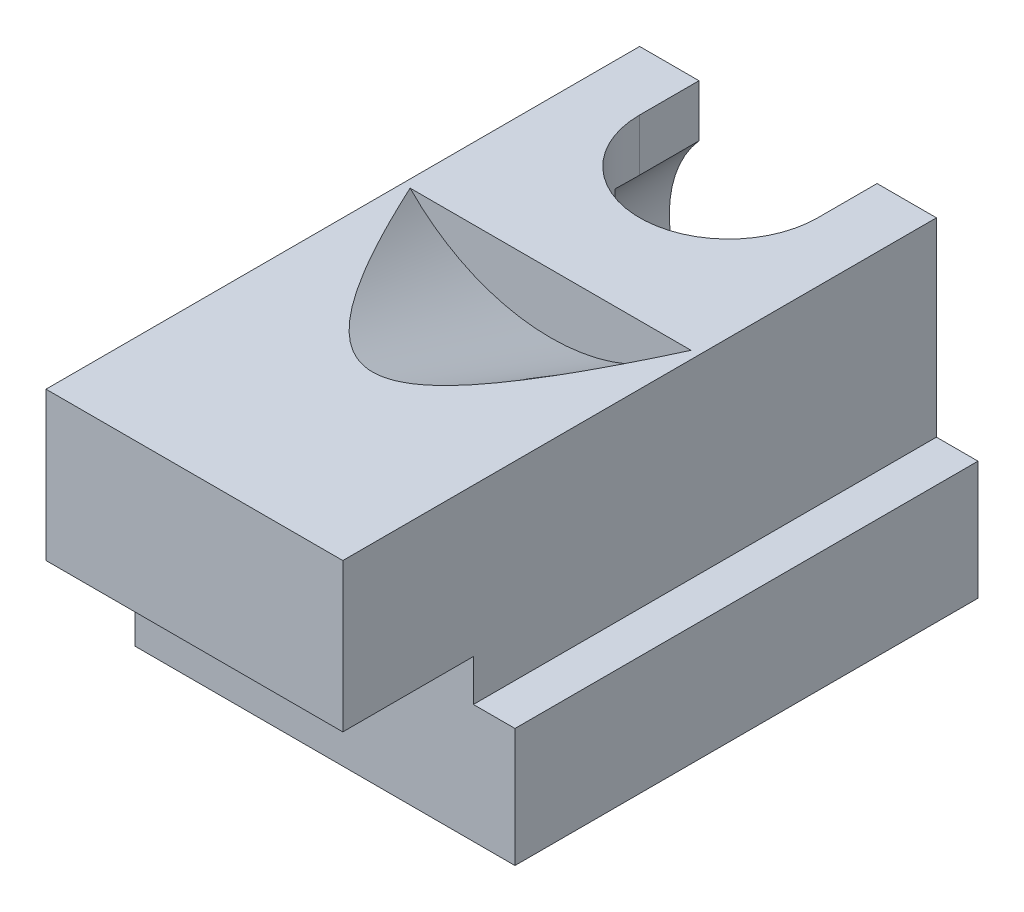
ISO-10303-21;
HEADER;
FILE_DESCRIPTION(('STEP AP214'),'2;1');
FILE_NAME('part.step','',(''),(''),'','','');
FILE_SCHEMA(('AUTOMOTIVE_DESIGN { 1 0 10303 214 1 1 1 1 }'));
ENDSEC;
DATA;
#1=APPLICATION_CONTEXT('core data for automotive mechanical design processes');
#2=APPLICATION_PROTOCOL_DEFINITION('international standard','automotive_design',2000,#1);
#3=PRODUCT_CONTEXT('',#1,'mechanical');
#4=PRODUCT('Part','Part','',(#3));
#5=PRODUCT_RELATED_PRODUCT_CATEGORY('part','',(#4));
#6=PRODUCT_DEFINITION_FORMATION('','',#4);
#7=PRODUCT_DEFINITION_CONTEXT('part definition',#1,'design');
#8=PRODUCT_DEFINITION('design','',#6,#7);
#9=PRODUCT_DEFINITION_SHAPE('','',#8);
#10=(LENGTH_UNIT() NAMED_UNIT(*) SI_UNIT(.MILLI.,.METRE.));
#11=(NAMED_UNIT(*) PLANE_ANGLE_UNIT() SI_UNIT($,.RADIAN.));
#12=(NAMED_UNIT(*) SI_UNIT($,.STERADIAN.) SOLID_ANGLE_UNIT());
#13=UNCERTAINTY_MEASURE_WITH_UNIT(LENGTH_MEASURE(1.E-05),#10,'distance_accuracy_value','');
#14=(GEOMETRIC_REPRESENTATION_CONTEXT(3) GLOBAL_UNCERTAINTY_ASSIGNED_CONTEXT((#13)) GLOBAL_UNIT_ASSIGNED_CONTEXT((#10,
#11,#12)) REPRESENTATION_CONTEXT('',''));
#15=CARTESIAN_POINT('',(0.,0.,0.));
#16=DIRECTION('',(0.,0.,1.));
#17=DIRECTION('',(1.,0.,0.));
#18=AXIS2_PLACEMENT_3D('',#15,#16,#17);
#19=CARTESIAN_POINT('',(-3.2,0.,10.));
#20=DIRECTION('',(1.,0.,0.));
#21=DIRECTION('',(0.,1.,0.));
#22=AXIS2_PLACEMENT_3D('',#19,#20,#21);
#23=PLANE('',#22);
#24=DIRECTION('',(0.,0.,-1.));
#25=VECTOR('',#24,1.);
#26=CARTESIAN_POINT('',(-3.2,0.,10.));
#27=LINE('',#26,#25);
#28=CARTESIAN_POINT('',(-3.2,0.,7.8));
#29=VERTEX_POINT('',#28);
#30=CARTESIAN_POINT('',(-3.2,0.,0.));
#31=VERTEX_POINT('',#30);
#32=EDGE_CURVE('E296',#29,#31,#27,.T.);
#33=ORIENTED_EDGE('',*,*,#32,.F.);
#34=DIRECTION('',(0.,1.,0.));
#35=VECTOR('',#34,1.);
#36=CARTESIAN_POINT('',(-3.2,0.,7.8));
#37=LINE('',#36,#35);
#38=CARTESIAN_POINT('',(-3.2,2.,7.8));
#39=VERTEX_POINT('',#38);
#40=EDGE_CURVE('E530',#29,#39,#37,.T.);
#41=ORIENTED_EDGE('',*,*,#40,.T.);
#42=DIRECTION('',(0.,0.,-1.));
#43=VECTOR('',#42,1.);
#44=CARTESIAN_POINT('',(-3.2,2.,10.));
#45=LINE('',#44,#43);
#46=CARTESIAN_POINT('',(-3.2,2.,0.));
#47=VERTEX_POINT('',#46);
#48=EDGE_CURVE('E309',#39,#47,#45,.T.);
#49=ORIENTED_EDGE('',*,*,#48,.T.);
#50=DIRECTION('',(0.,-1.,0.));
#51=VECTOR('',#50,1.);
#52=CARTESIAN_POINT('',(-3.2,0.,0.));
#53=LINE('',#52,#51);
#54=EDGE_CURVE('E317',#47,#31,#53,.T.);
#55=ORIENTED_EDGE('',*,*,#54,.T.);
#56=EDGE_LOOP('',(#33,#41,#49,#55));
#57=FACE_BOUND('',#56,.T.);
#58=ADVANCED_FACE('F32',(#57),#23,.F.);
#59=CARTESIAN_POINT('',(3.20000000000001,0.,10.));
#60=DIRECTION('',(0.,1.,0.));
#61=DIRECTION('',(-1.,0.,0.));
#62=AXIS2_PLACEMENT_3D('',#59,#60,#61);
#63=PLANE('',#62);
#64=DIRECTION('',(0.,0.,-1.));
#65=VECTOR('',#64,1.);
#66=CARTESIAN_POINT('',(3.20000000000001,0.,10.));
#67=LINE('',#66,#65);
#68=CARTESIAN_POINT('',(3.20000000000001,0.,7.8));
#69=VERTEX_POINT('',#68);
#70=CARTESIAN_POINT('',(3.20000000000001,0.,0.));
#71=VERTEX_POINT('',#70);
#72=EDGE_CURVE('E351',#69,#71,#67,.T.);
#73=ORIENTED_EDGE('',*,*,#72,.F.);
#74=DIRECTION('',(1.,0.,0.));
#75=VECTOR('',#74,1.);
#76=CARTESIAN_POINT('',(-3.2,0.,7.8));
#77=LINE('',#76,#75);
#78=EDGE_CURVE('E535',#29,#69,#77,.T.);
#79=ORIENTED_EDGE('',*,*,#78,.F.);
#80=ORIENTED_EDGE('',*,*,#32,.T.);
#81=DIRECTION('',(1.,0.,0.));
#82=VECTOR('',#81,1.);
#83=CARTESIAN_POINT('',(3.20000000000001,0.,0.));
#84=LINE('',#83,#82);
#85=EDGE_CURVE('E320',#31,#71,#84,.T.);
#86=ORIENTED_EDGE('',*,*,#85,.T.);
#87=EDGE_LOOP('',(#73,#79,#80,#86));
#88=FACE_BOUND('',#87,.T.);
#89=ADVANCED_FACE('F242',(#88),#63,.F.);
#90=CARTESIAN_POINT('',(3.20000000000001,0.,10.));
#91=DIRECTION('',(-1.,0.,0.));
#92=DIRECTION('',(0.,-1.,0.));
#93=AXIS2_PLACEMENT_3D('',#90,#91,#92);
#94=PLANE('',#93);
#95=DIRECTION('',(0.,0.,-1.));
#96=VECTOR('',#95,1.);
#97=CARTESIAN_POINT('',(3.2,2.,10.));
#98=LINE('',#97,#96);
#99=CARTESIAN_POINT('',(3.2,2.,7.8));
#100=VERTEX_POINT('',#99);
#101=CARTESIAN_POINT('',(3.2,2.,0.));
#102=VERTEX_POINT('',#101);
#103=EDGE_CURVE('E349',#100,#102,#98,.T.);
#104=ORIENTED_EDGE('',*,*,#103,.F.);
#105=DIRECTION('',(0.,1.,0.));
#106=VECTOR('',#105,1.);
#107=CARTESIAN_POINT('',(3.20000000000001,0.,7.8));
#108=LINE('',#107,#106);
#109=EDGE_CURVE('E528',#69,#100,#108,.T.);
#110=ORIENTED_EDGE('',*,*,#109,.F.);
#111=ORIENTED_EDGE('',*,*,#72,.T.);
#112=DIRECTION('',(0.,1.,0.));
#113=VECTOR('',#112,1.);
#114=CARTESIAN_POINT('',(3.20000000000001,0.,0.));
#115=LINE('',#114,#113);
#116=EDGE_CURVE('E324',#71,#102,#115,.T.);
#117=ORIENTED_EDGE('',*,*,#116,.T.);
#118=EDGE_LOOP('',(#104,#110,#111,#117));
#119=FACE_BOUND('',#118,.T.);
#120=ADVANCED_FACE('F247',(#119),#94,.F.);
#121=CARTESIAN_POINT('',(3.2,2.,10.));
#122=DIRECTION('',(0.,-1.,0.));
#123=DIRECTION('',(0.,0.,-1.));
#124=AXIS2_PLACEMENT_3D('',#121,#122,#123);
#125=PLANE('',#124);
#126=DIRECTION('',(0.,0.,-1.));
#127=VECTOR('',#126,1.);
#128=CARTESIAN_POINT('',(2.5,2.,10.));
#129=LINE('',#128,#127);
#130=CARTESIAN_POINT('',(2.5,2.,7.8));
#131=VERTEX_POINT('',#130);
#132=CARTESIAN_POINT('',(2.5,2.,0.));
#133=VERTEX_POINT('',#132);
#134=EDGE_CURVE('E347',#131,#133,#129,.T.);
#135=ORIENTED_EDGE('',*,*,#134,.F.);
#136=DIRECTION('',(1.,0.,0.));
#137=VECTOR('',#136,1.);
#138=CARTESIAN_POINT('',(3.2,2.,7.8));
#139=LINE('',#138,#137);
#140=EDGE_CURVE('E321',#131,#100,#139,.T.);
#141=ORIENTED_EDGE('',*,*,#140,.T.);
#142=ORIENTED_EDGE('',*,*,#103,.T.);
#143=DIRECTION('',(-1.,0.,0.));
#144=VECTOR('',#143,1.);
#145=CARTESIAN_POINT('',(3.2,2.,0.));
#146=LINE('',#145,#144);
#147=EDGE_CURVE('E327',#102,#133,#146,.T.);
#148=ORIENTED_EDGE('',*,*,#147,.T.);
#149=EDGE_LOOP('',(#135,#141,#142,#148));
#150=FACE_BOUND('',#149,.T.);
#151=ADVANCED_FACE('F254',(#150),#125,.F.);
#152=CARTESIAN_POINT('',(2.5,2.,10.));
#153=DIRECTION('',(-1.,0.,0.));
#154=DIRECTION('',(0.,-1.,0.));
#155=AXIS2_PLACEMENT_3D('',#152,#153,#154);
#156=PLANE('',#155);
#157=DIRECTION('',(0.,1.,0.));
#158=VECTOR('',#157,1.);
#159=CARTESIAN_POINT('',(2.5,2.,10.));
#160=LINE('',#159,#158);
#161=CARTESIAN_POINT('',(2.5,2.69999999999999,10.));
#162=VERTEX_POINT('',#161);
#163=CARTESIAN_POINT('',(2.5,5.2,10.));
#164=VERTEX_POINT('',#163);
#165=EDGE_CURVE('E313',#162,#164,#160,.T.);
#166=ORIENTED_EDGE('',*,*,#165,.F.);
#167=DIRECTION('',(0.,0.,-1.));
#168=VECTOR('',#167,1.);
#169=CARTESIAN_POINT('',(2.5,2.7,10.));
#170=LINE('',#169,#168);
#171=CARTESIAN_POINT('',(2.5,2.7,7.8));
#172=VERTEX_POINT('',#171);
#173=EDGE_CURVE('E292',#162,#172,#170,.T.);
#174=ORIENTED_EDGE('',*,*,#173,.T.);
#175=DIRECTION('',(0.,-1.,0.));
#176=VECTOR('',#175,1.);
#177=CARTESIAN_POINT('',(2.5,2.,7.8));
#178=LINE('',#177,#176);
#179=EDGE_CURVE('E541',#172,#131,#178,.T.);
#180=ORIENTED_EDGE('',*,*,#179,.T.);
#181=ORIENTED_EDGE('',*,*,#134,.T.);
#182=DIRECTION('',(0.,1.,0.));
#183=VECTOR('',#182,1.);
#184=CARTESIAN_POINT('',(2.5,2.,0.));
#185=LINE('',#184,#183);
#186=CARTESIAN_POINT('',(2.5,5.2,0.));
#187=VERTEX_POINT('',#186);
#188=EDGE_CURVE('E330',#133,#187,#185,.T.);
#189=ORIENTED_EDGE('',*,*,#188,.T.);
#190=DIRECTION('',(0.,0.,-1.));
#191=VECTOR('',#190,1.);
#192=CARTESIAN_POINT('',(2.5,5.2,10.));
#193=LINE('',#192,#191);
#194=EDGE_CURVE('E344',#164,#187,#193,.T.);
#195=ORIENTED_EDGE('',*,*,#194,.F.);
#196=EDGE_LOOP('',(#166,#174,#180,#181,#189,#195));
#197=FACE_BOUND('',#196,.T.);
#198=ADVANCED_FACE('F174',(#197),#156,.F.);
#199=CARTESIAN_POINT('',(2.5,5.2,10.));
#200=DIRECTION('',(0.,-1.,0.));
#201=DIRECTION('',(0.,0.,-1.));
#202=AXIS2_PLACEMENT_3D('',#199,#200,#201);
#203=PLANE('',#202);
#204=DIRECTION('',(1.,0.,0.));
#205=VECTOR('',#204,1.);
#206=CARTESIAN_POINT('',(2.5,5.2,4.));
#207=LINE('',#206,#205);
#208=CARTESIAN_POINT('',(-2.36643191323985,5.2,4.));
#209=VERTEX_POINT('',#208);
#210=CARTESIAN_POINT('',(2.36643191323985,5.2,4.));
#211=VERTEX_POINT('',#210);
#212=EDGE_CURVE('E46',#209,#211,#207,.T.);
#213=ORIENTED_EDGE('',*,*,#212,.T.);
#214=CARTESIAN_POINT('',(-3.80436770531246,5.2,0.563249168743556));
#215=CARTESIAN_POINT('',(-3.73620337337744,5.2,0.738226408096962));
#216=CARTESIAN_POINT('',(-3.66762616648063,5.2,0.913044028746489));
#217=CARTESIAN_POINT('',(-3.52946847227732,5.2,1.26228931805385));
#218=CARTESIAN_POINT('',(-3.45988794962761,5.2,1.43671697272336));
#219=CARTESIAN_POINT('',(-3.31943291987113,5.2,1.78539208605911));
#220=CARTESIAN_POINT('',(-3.2485564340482,5.2,1.95963874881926));
#221=CARTESIAN_POINT('',(-3.1053868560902,5.2,2.30754675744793));
#222=CARTESIAN_POINT('',(-3.03309378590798,5.2,2.48120811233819));
#223=CARTESIAN_POINT('',(-2.88329309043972,5.2,2.83607274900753));
#224=CARTESIAN_POINT('',(-2.80570123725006,5.2,3.01724055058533));
#225=CARTESIAN_POINT('',(-2.64815027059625,5.2,3.37854336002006));
#226=CARTESIAN_POINT('',(-2.56819119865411,5.2,3.55867838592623));
#227=CARTESIAN_POINT('',(-2.40530869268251,5.2,3.91741178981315));
#228=CARTESIAN_POINT('',(-2.3223879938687,5.2,4.09601140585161));
#229=CARTESIAN_POINT('',(-2.15255644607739,5.2,4.451296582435));
#230=CARTESIAN_POINT('',(-2.06564600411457,5.2,4.62798233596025));
#231=CARTESIAN_POINT('',(-1.9016793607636,5.2,4.94852239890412));
#232=CARTESIAN_POINT('',(-1.825485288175,5.2,5.09281627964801));
#233=CARTESIAN_POINT('',(-1.66789202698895,5.2,5.37879184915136));
#234=CARTESIAN_POINT('',(-1.58648701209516,5.2,5.52047037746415));
#235=CARTESIAN_POINT('',(-1.45933315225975,5.2,5.72896341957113));
#236=CARTESIAN_POINT('',(-1.41633696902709,5.2,5.79745457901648));
#237=CARTESIAN_POINT('',(-1.32815386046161,5.2,5.93300687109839));
#238=CARTESIAN_POINT('',(-1.28296725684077,5.2,6.00006821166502));
#239=CARTESIAN_POINT('',(-1.18996475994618,5.2,6.13217716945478));
#240=CARTESIAN_POINT('',(-1.14215359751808,5.2,6.19722809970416));
#241=CARTESIAN_POINT('',(-1.04314842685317,5.2,6.32468614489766));
#242=CARTESIAN_POINT('',(-0.991956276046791,5.2,6.38709468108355));
#243=CARTESIAN_POINT('',(-0.911785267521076,5.2,6.47796079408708));
#244=CARTESIAN_POINT('',(-0.884435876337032,5.2,6.50785247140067));
#245=CARTESIAN_POINT('',(-0.828477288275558,5.2,6.56643384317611));
#246=CARTESIAN_POINT('',(-0.799867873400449,5.2,6.5951233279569));
#247=CARTESIAN_POINT('',(-0.71188729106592,5.2,6.67898583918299));
#248=CARTESIAN_POINT('',(-0.650340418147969,5.2,6.73198021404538));
#249=CARTESIAN_POINT('',(-0.536174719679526,5.2,6.81641935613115));
#250=CARTESIAN_POINT('',(-0.485121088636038,5.2,6.84995037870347));
#251=CARTESIAN_POINT('',(-0.378504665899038,5.2,6.90894409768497));
#252=CARTESIAN_POINT('',(-0.322952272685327,5.2,6.93442476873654));
#253=CARTESIAN_POINT('',(-0.222602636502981,5.2,6.96893087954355));
#254=CARTESIAN_POINT('',(-0.178694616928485,5.2,6.98049931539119));
#255=CARTESIAN_POINT('',(-0.0895684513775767,5.2,6.99605374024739));
#256=CARTESIAN_POINT('',(-0.0443522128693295,5.2,7.00005025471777));
#257=CARTESIAN_POINT('',(0.0461536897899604,5.2,6.99994868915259));
#258=CARTESIAN_POINT('',(0.0914433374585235,5.2,6.99583583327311));
#259=CARTESIAN_POINT('',(0.180690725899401,5.2,6.98003626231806));
#260=CARTESIAN_POINT('',(0.224646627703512,5.2,6.96833954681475));
#261=CARTESIAN_POINT('',(0.326981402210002,5.2,6.93287763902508));
#262=CARTESIAN_POINT('',(0.384330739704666,5.2,6.9061894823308));
#263=CARTESIAN_POINT('',(0.494231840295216,5.2,6.84436750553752));
#264=CARTESIAN_POINT('',(0.546771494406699,5.2,6.80921313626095));
#265=CARTESIAN_POINT('',(0.65860890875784,5.2,6.72490341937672));
#266=CARTESIAN_POINT('',(0.716847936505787,5.2,6.6743695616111));
#267=CARTESIAN_POINT('',(0.828265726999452,5.2,6.56793878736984));
#268=CARTESIAN_POINT('',(0.881434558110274,5.2,6.51203175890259));
#269=CARTESIAN_POINT('',(0.984089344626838,5.2,6.39630565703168));
#270=CARTESIAN_POINT('',(1.03354840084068,5.2,6.33646299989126));
#271=CARTESIAN_POINT('',(1.12921120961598,5.2,6.21434809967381));
#272=CARTESIAN_POINT('',(1.17541801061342,5.2,6.15207821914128));
#273=CARTESIAN_POINT('',(1.26808397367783,5.2,6.02178143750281));
#274=CARTESIAN_POINT('',(1.31437829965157,5.2,5.95363800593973));
#275=CARTESIAN_POINT('',(1.40464980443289,5.2,5.81582786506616));
#276=CARTESIAN_POINT('',(1.44862661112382,5.2,5.74616091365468));
#277=CARTESIAN_POINT('',(1.57778702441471,5.2,5.53534819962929));
#278=CARTESIAN_POINT('',(1.660143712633,5.2,5.39247319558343));
#279=CARTESIAN_POINT('',(1.8197998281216,5.2,5.10347916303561));
#280=CARTESIAN_POINT('',(1.89708534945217,5.2,4.95735257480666));
#281=CARTESIAN_POINT('',(2.04772516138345,5.2,4.66315981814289));
#282=CARTESIAN_POINT('',(2.12108082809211,5.2,4.51509435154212));
#283=CARTESIAN_POINT('',(2.26504055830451,5.2,4.21706498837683));
#284=CARTESIAN_POINT('',(2.33563524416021,5.2,4.0670965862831));
#285=CARTESIAN_POINT('',(2.47447722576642,5.2,3.76606496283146));
#286=CARTESIAN_POINT('',(2.54272432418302,5.2,3.61500165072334));
#287=CARTESIAN_POINT('',(2.67721908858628,5.2,3.31228211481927));
#288=CARTESIAN_POINT('',(2.74346980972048,5.2,3.16062724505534));
#289=CARTESIAN_POINT('',(2.87442481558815,5.2,2.85665804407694));
#290=CARTESIAN_POINT('',(2.93912914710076,5.2,2.70434373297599));
#291=CARTESIAN_POINT('',(3.09667751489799,5.2,2.32910781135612));
#292=CARTESIAN_POINT('',(3.18879862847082,5.2,2.10588284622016));
#293=CARTESIAN_POINT('',(3.37090859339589,5.2,1.65856370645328));
#294=CARTESIAN_POINT('',(3.46089741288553,5.2,1.43446951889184));
#295=CARTESIAN_POINT('',(3.72833663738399,5.2,0.761155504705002));
#296=CARTESIAN_POINT('',(3.90324976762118,5.2,0.310928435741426));
#297=CARTESIAN_POINT('',(4.24869926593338,5.2,-0.591677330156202));
#298=CARTESIAN_POINT('',(4.41923135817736,5.2,-1.04405765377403));
#299=CARTESIAN_POINT('',(4.75703612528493,5.2,-1.95001587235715));
#300=CARTESIAN_POINT('',(4.92430890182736,5.2,-2.40359372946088));
#301=CARTESIAN_POINT('',(5.2512069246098,5.2,-3.29730255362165));
#302=CARTESIAN_POINT('',(5.41090693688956,5.2,-3.73740622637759));
#303=CARTESIAN_POINT('',(5.72856811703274,5.2,-4.61824534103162));
#304=CARTESIAN_POINT('',(5.88652926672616,5.2,-5.05898078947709));
#305=CARTESIAN_POINT('',(6.20088001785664,5.2,-5.9403641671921));
#306=CARTESIAN_POINT('',(6.35727139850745,5.2,-6.3810114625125));
#307=CARTESIAN_POINT('',(6.66894341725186,5.2,-7.26269073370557));
#308=CARTESIAN_POINT('',(6.82422407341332,5.2,-7.70372270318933));
#309=CARTESIAN_POINT('',(6.97907809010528,5.2,-8.14490369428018));
#310=B_SPLINE_CURVE_WITH_KNOTS('',3,(#214,#215,#216,#217,#218,#219,#220,#221,#222,#223,#224,
#225,#226,#227,#228,#229,#230,#231,#232,#233,#234,#235,#236,#237,#238,#239,#240,#241,#242,#243,
#244,#245,#246,#247,#248,#249,#250,#251,#252,#253,#254,#255,#256,#257,#258,#259,#260,#261,#262,
#263,#264,#265,#266,#267,#268,#269,#270,#271,#272,#273,#274,#275,#276,#277,#278,#279,#280,#281,
#282,#283,#284,#285,#286,#287,#288,#289,#290,#291,#292,#293,#294,#295,#296,#297,#298,#299,#300,
#301,#302,#303,#304,#305,#306,#307,#308,#309),.UNSPECIFIED.,.F.,.F.,(4,2,2,2,2,2,2,2,2,2,2,2,2,
2,2,2,2,2,2,2,2,2,2,2,2,2,2,2,2,2,2,2,2,2,2,2,2,2,2,2,2,2,2,2,2,2,2,4),(0.,0.563357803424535,
1.12673550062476,1.69106031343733,2.25537638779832,2.84661660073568,3.4378464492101,
4.02854371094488,4.61918084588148,5.10864518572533,5.59866668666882,5.8412408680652,
6.08377952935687,6.32589451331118,6.56787757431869,6.68938816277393,6.81091985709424,
7.05387580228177,7.23664653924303,7.41900625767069,7.55466271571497,7.69013046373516,
7.82584527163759,7.96173940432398,8.15041804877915,8.33955935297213,8.57034174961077,
8.80156730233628,9.03433349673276,9.26687852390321,9.51396238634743,9.76108580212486,
10.255633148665,10.751484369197,11.2471608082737,11.7443958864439,12.2416726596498,
12.738145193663,13.2346026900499,13.959046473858,14.6835010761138,16.1324888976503,
17.5828409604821,19.0331477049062,20.4376923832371,21.8422517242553,23.2449813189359,
24.6476880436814),.UNSPECIFIED.);
#311=EDGE_CURVE('E11',#211,#209,#310,.F.);
#312=ORIENTED_EDGE('',*,*,#311,.T.);
#313=EDGE_LOOP('',(#213,#312));
#314=FACE_BOUND('',#313,.T.);
#315=CARTESIAN_POINT('',(0.,5.2,1.));
#316=DIRECTION('',(0.,1.,0.));
#317=DIRECTION('',(0.,0.,1.));
#318=AXIS2_PLACEMENT_3D('',#315,#316,#317);
#319=CIRCLE('',#318,1.5);
#320=CARTESIAN_POINT('',(-1.5,5.2,1.));
#321=VERTEX_POINT('',#320);
#322=CARTESIAN_POINT('',(1.5,5.2,1.));
#323=VERTEX_POINT('',#322);
#324=EDGE_CURVE('E179',#321,#323,#319,.T.);
#325=ORIENTED_EDGE('',*,*,#324,.F.);
#326=DIRECTION('',(0.,0.,1.));
#327=VECTOR('',#326,1.);
#328=CARTESIAN_POINT('',(-1.5,5.2,1.));
#329=LINE('',#328,#327);
#330=CARTESIAN_POINT('',(-1.5,5.2,0.));
#331=VERTEX_POINT('',#330);
#332=EDGE_CURVE('E181',#331,#321,#329,.T.);
#333=ORIENTED_EDGE('',*,*,#332,.F.);
#334=DIRECTION('',(-1.,0.,0.));
#335=VECTOR('',#334,1.);
#336=CARTESIAN_POINT('',(2.5,5.2,0.));
#337=LINE('',#336,#335);
#338=CARTESIAN_POINT('',(-2.5,5.2,0.));
#339=VERTEX_POINT('',#338);
#340=EDGE_CURVE('E332',#331,#339,#337,.T.);
#341=ORIENTED_EDGE('',*,*,#340,.T.);
#342=DIRECTION('',(0.,0.,-1.));
#343=VECTOR('',#342,1.);
#344=CARTESIAN_POINT('',(-2.5,5.2,10.));
#345=LINE('',#344,#343);
#346=CARTESIAN_POINT('',(-2.5,5.2,10.));
#347=VERTEX_POINT('',#346);
#348=EDGE_CURVE('E342',#347,#339,#345,.T.);
#349=ORIENTED_EDGE('',*,*,#348,.F.);
#350=DIRECTION('',(-1.,0.,0.));
#351=VECTOR('',#350,1.);
#352=CARTESIAN_POINT('',(2.5,5.2,10.));
#353=LINE('',#352,#351);
#354=EDGE_CURVE('E307',#164,#347,#353,.T.);
#355=ORIENTED_EDGE('',*,*,#354,.F.);
#356=ORIENTED_EDGE('',*,*,#194,.T.);
#357=CARTESIAN_POINT('',(1.5,5.2,0.));
#358=VERTEX_POINT('',#357);
#359=EDGE_CURVE('E333',#187,#358,#337,.T.);
#360=ORIENTED_EDGE('',*,*,#359,.T.);
#361=DIRECTION('',(0.,0.,-1.));
#362=VECTOR('',#361,1.);
#363=CARTESIAN_POINT('',(1.5,5.2,0.));
#364=LINE('',#363,#362);
#365=EDGE_CURVE('E184',#323,#358,#364,.T.);
#366=ORIENTED_EDGE('',*,*,#365,.F.);
#367=EDGE_LOOP('',(#325,#333,#341,#349,#355,#356,#360,#366));
#368=FACE_BOUND('',#367,.T.);
#369=ADVANCED_FACE('F170',(#314,#368),#203,.F.);
#370=CARTESIAN_POINT('',(-2.5,2.,10.));
#371=DIRECTION('',(1.,0.,0.));
#372=DIRECTION('',(0.,1.,0.));
#373=AXIS2_PLACEMENT_3D('',#370,#371,#372);
#374=PLANE('',#373);
#375=DIRECTION('',(0.,1.,0.));
#376=VECTOR('',#375,1.);
#377=CARTESIAN_POINT('',(-2.5,2.,7.8));
#378=LINE('',#377,#376);
#379=CARTESIAN_POINT('',(-2.5,2.,7.8));
#380=VERTEX_POINT('',#379);
#381=CARTESIAN_POINT('',(-2.5,2.69999999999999,7.8));
#382=VERTEX_POINT('',#381);
#383=EDGE_CURVE('E303',#380,#382,#378,.T.);
#384=ORIENTED_EDGE('',*,*,#383,.T.);
#385=DIRECTION('',(0.,0.,1.));
#386=VECTOR('',#385,1.);
#387=CARTESIAN_POINT('',(-2.5,2.69999999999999,10.));
#388=LINE('',#387,#386);
#389=CARTESIAN_POINT('',(-2.5,2.69999999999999,10.));
#390=VERTEX_POINT('',#389);
#391=EDGE_CURVE('E289',#382,#390,#388,.T.);
#392=ORIENTED_EDGE('',*,*,#391,.T.);
#393=DIRECTION('',(0.,-1.,0.));
#394=VECTOR('',#393,1.);
#395=CARTESIAN_POINT('',(-2.5,2.,10.));
#396=LINE('',#395,#394);
#397=EDGE_CURVE('E301',#347,#390,#396,.T.);
#398=ORIENTED_EDGE('',*,*,#397,.F.);
#399=ORIENTED_EDGE('',*,*,#348,.T.);
#400=DIRECTION('',(0.,-1.,0.));
#401=VECTOR('',#400,1.);
#402=CARTESIAN_POINT('',(-2.5,2.,0.));
#403=LINE('',#402,#401);
#404=CARTESIAN_POINT('',(-2.5,2.,0.));
#405=VERTEX_POINT('',#404);
#406=EDGE_CURVE('E335',#339,#405,#403,.T.);
#407=ORIENTED_EDGE('',*,*,#406,.T.);
#408=DIRECTION('',(0.,0.,-1.));
#409=VECTOR('',#408,1.);
#410=CARTESIAN_POINT('',(-2.5,2.,10.));
#411=LINE('',#410,#409);
#412=EDGE_CURVE('E311',#380,#405,#411,.T.);
#413=ORIENTED_EDGE('',*,*,#412,.F.);
#414=EDGE_LOOP('',(#384,#392,#398,#399,#407,#413));
#415=FACE_BOUND('',#414,.T.);
#416=ADVANCED_FACE('F173',(#415),#374,.F.);
#417=CARTESIAN_POINT('',(-3.2,2.,10.));
#418=DIRECTION('',(0.,-1.,0.));
#419=DIRECTION('',(0.,0.,-1.));
#420=AXIS2_PLACEMENT_3D('',#417,#418,#419);
#421=PLANE('',#420);
#422=ORIENTED_EDGE('',*,*,#48,.F.);
#423=DIRECTION('',(1.,0.,0.));
#424=VECTOR('',#423,1.);
#425=CARTESIAN_POINT('',(-3.2,2.,7.8));
#426=LINE('',#425,#424);
#427=EDGE_CURVE('E295',#39,#380,#426,.T.);
#428=ORIENTED_EDGE('',*,*,#427,.T.);
#429=ORIENTED_EDGE('',*,*,#412,.T.);
#430=DIRECTION('',(-1.,0.,0.));
#431=VECTOR('',#430,1.);
#432=CARTESIAN_POINT('',(-3.2,2.,0.));
#433=LINE('',#432,#431);
#434=EDGE_CURVE('E338',#405,#47,#433,.T.);
#435=ORIENTED_EDGE('',*,*,#434,.T.);
#436=EDGE_LOOP('',(#422,#428,#429,#435));
#437=FACE_BOUND('',#436,.T.);
#438=ADVANCED_FACE('F265',(#437),#421,.F.);
#439=CARTESIAN_POINT('',(0.,0.,10.));
#440=DIRECTION('',(0.,0.,-1.));
#441=DIRECTION('',(-1.,0.,0.));
#442=AXIS2_PLACEMENT_3D('',#439,#440,#441);
#443=PLANE('',#442);
#444=ORIENTED_EDGE('',*,*,#397,.T.);
#445=DIRECTION('',(1.,0.,0.));
#446=VECTOR('',#445,1.);
#447=CARTESIAN_POINT('',(0.,2.69999999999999,10.));
#448=LINE('',#447,#446);
#449=EDGE_CURVE('E286',#390,#162,#448,.T.);
#450=ORIENTED_EDGE('',*,*,#449,.T.);
#451=ORIENTED_EDGE('',*,*,#165,.T.);
#452=ORIENTED_EDGE('',*,*,#354,.T.);
#453=EDGE_LOOP('',(#444,#450,#451,#452));
#454=FACE_BOUND('',#453,.T.);
#455=ADVANCED_FACE('F269',(#454),#443,.F.);
#456=CARTESIAN_POINT('',(0.,0.,0.));
#457=DIRECTION('',(0.,0.,-1.));
#458=DIRECTION('',(-1.,0.,0.));
#459=AXIS2_PLACEMENT_3D('',#456,#457,#458);
#460=PLANE('',#459);
#461=DIRECTION('',(0.,1.,0.));
#462=VECTOR('',#461,1.);
#463=CARTESIAN_POINT('',(-1.5,3.2,0.));
#464=LINE('',#463,#462);
#465=CARTESIAN_POINT('',(-1.5,4.32287565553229,0.));
#466=VERTEX_POINT('',#465);
#467=EDGE_CURVE('E198',#466,#331,#464,.T.);
#468=ORIENTED_EDGE('',*,*,#467,.F.);
#469=CARTESIAN_POINT('',(0.,3.,0.));
#470=DIRECTION('',(0.,0.,-1.));
#471=DIRECTION('',(-1.,0.,0.));
#472=AXIS2_PLACEMENT_3D('',#469,#470,#471);
#473=CIRCLE('',#472,2.);
#474=CARTESIAN_POINT('',(1.5,4.32287565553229,0.));
#475=VERTEX_POINT('',#474);
#476=EDGE_CURVE('E529',#475,#466,#473,.T.);
#477=ORIENTED_EDGE('',*,*,#476,.F.);
#478=DIRECTION('',(0.,1.,0.));
#479=VECTOR('',#478,1.);
#480=CARTESIAN_POINT('',(1.5,3.2,0.));
#481=LINE('',#480,#479);
#482=EDGE_CURVE('E200',#475,#358,#481,.T.);
#483=ORIENTED_EDGE('',*,*,#482,.T.);
#484=ORIENTED_EDGE('',*,*,#359,.F.);
#485=ORIENTED_EDGE('',*,*,#188,.F.);
#486=ORIENTED_EDGE('',*,*,#147,.F.);
#487=ORIENTED_EDGE('',*,*,#116,.F.);
#488=ORIENTED_EDGE('',*,*,#85,.F.);
#489=ORIENTED_EDGE('',*,*,#54,.F.);
#490=ORIENTED_EDGE('',*,*,#434,.F.);
#491=ORIENTED_EDGE('',*,*,#406,.F.);
#492=ORIENTED_EDGE('',*,*,#340,.F.);
#493=EDGE_LOOP('',(#468,#477,#483,#484,#485,#486,#487,#488,#489,#490,#491,#492));
#494=FACE_BOUND('',#493,.T.);
#495=ADVANCED_FACE('F271',(#494),#460,.T.);
#496=CARTESIAN_POINT('',(-3.2,0.,7.8));
#497=DIRECTION('',(0.,0.,-1.));
#498=DIRECTION('',(-1.,0.,0.));
#499=AXIS2_PLACEMENT_3D('',#496,#497,#498);
#500=PLANE('',#499);
#501=ORIENTED_EDGE('',*,*,#179,.F.);
#502=DIRECTION('',(1.,0.,0.));
#503=VECTOR('',#502,1.);
#504=CARTESIAN_POINT('',(-3.20000000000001,2.69999999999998,7.8));
#505=LINE('',#504,#503);
#506=EDGE_CURVE('E304',#382,#172,#505,.T.);
#507=ORIENTED_EDGE('',*,*,#506,.F.);
#508=ORIENTED_EDGE('',*,*,#383,.F.);
#509=ORIENTED_EDGE('',*,*,#427,.F.);
#510=ORIENTED_EDGE('',*,*,#40,.F.);
#511=ORIENTED_EDGE('',*,*,#78,.T.);
#512=ORIENTED_EDGE('',*,*,#109,.T.);
#513=ORIENTED_EDGE('',*,*,#140,.F.);
#514=EDGE_LOOP('',(#501,#507,#508,#509,#510,#511,#512,#513));
#515=FACE_BOUND('',#514,.T.);
#516=ADVANCED_FACE('F274',(#515),#500,.F.);
#517=CARTESIAN_POINT('',(-3.20000000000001,2.69999999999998,10.));
#518=DIRECTION('',(0.,1.,0.));
#519=DIRECTION('',(-1.,0.,0.));
#520=AXIS2_PLACEMENT_3D('',#517,#518,#519);
#521=PLANE('',#520);
#522=ORIENTED_EDGE('',*,*,#449,.F.);
#523=ORIENTED_EDGE('',*,*,#391,.F.);
#524=ORIENTED_EDGE('',*,*,#506,.T.);
#525=ORIENTED_EDGE('',*,*,#173,.F.);
#526=EDGE_LOOP('',(#522,#523,#524,#525));
#527=FACE_BOUND('',#526,.T.);
#528=ADVANCED_FACE('F238',(#527),#521,.F.);
#529=CARTESIAN_POINT('',(0.,3.,1.5));
#530=DIRECTION('',(0.,0.,-1.));
#531=DIRECTION('',(-1.,0.,0.));
#532=AXIS2_PLACEMENT_3D('',#529,#530,#531);
#533=CYLINDRICAL_SURFACE('',#532,2.);
#534=DIRECTION('',(0.,0.,-1.));
#535=VECTOR('',#534,1.);
#536=CARTESIAN_POINT('',(-1.5,4.32287565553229,1.5));
#537=LINE('',#536,#535);
#538=CARTESIAN_POINT('',(-1.5,4.32287565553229,1.));
#539=VERTEX_POINT('',#538);
#540=EDGE_CURVE('E368',#466,#539,#537,.F.);
#541=ORIENTED_EDGE('',*,*,#540,.T.);
#542=CARTESIAN_POINT('',(-1.5,4.3228756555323,1.));
#543=CARTESIAN_POINT('',(-1.50000438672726,4.32286131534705,1.03185014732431));
#544=CARTESIAN_POINT('',(-1.49898488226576,4.3240270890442,1.06367286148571));
#545=CARTESIAN_POINT('',(-1.49494965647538,4.32858595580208,1.12699958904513));
#546=CARTESIAN_POINT('',(-1.49193598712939,4.33197675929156,1.15850389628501));
#547=CARTESIAN_POINT('',(-1.48012898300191,4.34512311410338,1.25105678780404));
#548=CARTESIAN_POINT('',(-1.4685645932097,4.35786354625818,1.31136996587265));
#549=CARTESIAN_POINT('',(-1.44805086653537,4.3795701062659,1.39201366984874));
#550=CARTESIAN_POINT('',(-1.44194930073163,4.38595451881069,1.4138784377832));
#551=CARTESIAN_POINT('',(-1.4287883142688,4.39951950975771,1.45725044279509));
#552=CARTESIAN_POINT('',(-1.42172244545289,4.40670538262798,1.47875407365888));
#553=CARTESIAN_POINT('',(-1.41421356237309,4.41421356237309,1.5));
#554=B_SPLINE_CURVE_WITH_KNOTS('',3,(#542,#543,#544,#545,#546,#547,#548,#549,#550,#551,#552,
#553),.UNSPECIFIED.,.F.,.F.,(4,2,2,2,2,4),(0.,0.0954624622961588,0.190826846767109,
0.377936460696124,0.448659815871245,0.519881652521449),.UNSPECIFIED.);
#555=CARTESIAN_POINT('',(-1.41421356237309,4.41421356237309,1.5));
#556=VERTEX_POINT('',#555);
#557=EDGE_CURVE('E212',#539,#556,#554,.T.);
#558=ORIENTED_EDGE('',*,*,#557,.T.);
#559=CARTESIAN_POINT('',(0.,3.,1.5));
#560=DIRECTION('',(0.,0.,-1.));
#561=DIRECTION('',(-1.,0.,0.));
#562=AXIS2_PLACEMENT_3D('',#559,#560,#561);
#563=CIRCLE('',#562,2.);
#564=CARTESIAN_POINT('',(1.4142135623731,4.41421356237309,1.5));
#565=VERTEX_POINT('',#564);
#566=EDGE_CURVE('E526',#565,#556,#563,.T.);
#567=ORIENTED_EDGE('',*,*,#566,.F.);
#568=CARTESIAN_POINT('',(1.4142135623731,4.41421356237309,1.5));
#569=CARTESIAN_POINT('',(1.42427451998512,4.40415393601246,1.47153021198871));
#570=CARTESIAN_POINT('',(1.43354319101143,4.39466975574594,1.44258697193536));
#571=CARTESIAN_POINT('',(1.45041061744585,4.37711855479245,1.38373648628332));
#572=CARTESIAN_POINT('',(1.45800614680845,4.36905427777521,1.35382750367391));
#573=CARTESIAN_POINT('',(1.47780442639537,4.34776639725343,1.26413605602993));
#574=CARTESIAN_POINT('',(1.48747255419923,4.33697791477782,1.20312199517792));
#575=CARTESIAN_POINT('',(1.49553224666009,4.32792756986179,1.11805578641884));
#576=CARTESIAN_POINT('',(1.49719718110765,4.32604828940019,1.09462947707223));
#577=CARTESIAN_POINT('',(1.49943536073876,4.32351646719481,1.04747408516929));
#578=CARTESIAN_POINT('',(1.49999993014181,4.32287367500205,1.0237440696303));
#579=CARTESIAN_POINT('',(1.5,4.32287565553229,1.));
#580=B_SPLINE_CURVE_WITH_KNOTS('',3,(#568,#569,#570,#571,#572,#573,#574,#575,#576,#577,#578,
#579),.UNSPECIFIED.,.F.,.F.,(4,2,2,2,2,4),(0.,0.0954351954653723,0.191052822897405,
0.378054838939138,0.448689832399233,0.519879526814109),.UNSPECIFIED.);
#581=CARTESIAN_POINT('',(1.5,4.32287565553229,1.));
#582=VERTEX_POINT('',#581);
#583=EDGE_CURVE('E197',#565,#582,#580,.T.);
#584=ORIENTED_EDGE('',*,*,#583,.T.);
#585=DIRECTION('',(0.,0.,-1.));
#586=VECTOR('',#585,1.);
#587=CARTESIAN_POINT('',(1.5,4.32287565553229,1.5));
#588=LINE('',#587,#586);
#589=EDGE_CURVE('E365',#582,#475,#588,.T.);
#590=ORIENTED_EDGE('',*,*,#589,.T.);
#591=ORIENTED_EDGE('',*,*,#476,.T.);
#592=EDGE_LOOP('',(#541,#558,#567,#584,#590,#591));
#593=FACE_BOUND('',#592,.T.);
#594=ADVANCED_FACE('F217',(#593),#533,.F.);
#595=CARTESIAN_POINT('',(0.,3.,1.5));
#596=DIRECTION('',(0.,0.,-1.));
#597=DIRECTION('',(-1.,0.,0.));
#598=AXIS2_PLACEMENT_3D('',#595,#596,#597);
#599=PLANE('',#598);
#600=CARTESIAN_POINT('',(0.,3.,1.5));
#601=DIRECTION('',(0.,0.,-1.));
#602=DIRECTION('',(-1.,0.,0.));
#603=AXIS2_PLACEMENT_3D('',#600,#601,#602);
#604=CIRCLE('',#603,0.7);
#605=CARTESIAN_POINT('',(0.670820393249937,3.2,1.5));
#606=VERTEX_POINT('',#605);
#607=CARTESIAN_POINT('',(-0.670820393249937,3.2,1.5));
#608=VERTEX_POINT('',#607);
#609=EDGE_CURVE('E168',#606,#608,#604,.T.);
#610=ORIENTED_EDGE('',*,*,#609,.F.);
#611=DIRECTION('',(1.,0.,0.));
#612=VECTOR('',#611,1.);
#613=CARTESIAN_POINT('',(0.,3.2,1.5));
#614=LINE('',#613,#612);
#615=CARTESIAN_POINT('',(1.4142135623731,3.2,1.5));
#616=VERTEX_POINT('',#615);
#617=EDGE_CURVE('E356',#606,#616,#614,.T.);
#618=ORIENTED_EDGE('',*,*,#617,.T.);
#619=DIRECTION('',(0.,1.,0.));
#620=VECTOR('',#619,1.);
#621=CARTESIAN_POINT('',(1.4142135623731,3.2,1.5));
#622=LINE('',#621,#620);
#623=EDGE_CURVE('E360',#565,#616,#622,.F.);
#624=ORIENTED_EDGE('',*,*,#623,.F.);
#625=ORIENTED_EDGE('',*,*,#566,.T.);
#626=DIRECTION('',(0.,1.,0.));
#627=VECTOR('',#626,1.);
#628=CARTESIAN_POINT('',(-1.41421356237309,3.2,1.5));
#629=LINE('',#628,#627);
#630=CARTESIAN_POINT('',(-1.41421356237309,3.2,1.5));
#631=VERTEX_POINT('',#630);
#632=EDGE_CURVE('E363',#631,#556,#629,.T.);
#633=ORIENTED_EDGE('',*,*,#632,.F.);
#634=EDGE_CURVE('E357',#631,#608,#614,.T.);
#635=ORIENTED_EDGE('',*,*,#634,.T.);
#636=EDGE_LOOP('',(#610,#618,#624,#625,#633,#635));
#637=FACE_BOUND('',#636,.T.);
#638=ADVANCED_FACE('F228',(#637),#599,.T.);
#639=CARTESIAN_POINT('',(-1.5,3.2,1.));
#640=DIRECTION('',(-1.,0.,0.));
#641=DIRECTION('',(0.,0.,1.));
#642=AXIS2_PLACEMENT_3D('',#639,#640,#641);
#643=PLANE('',#642);
#644=ORIENTED_EDGE('',*,*,#467,.T.);
#645=ORIENTED_EDGE('',*,*,#332,.T.);
#646=DIRECTION('',(0.,1.,0.));
#647=VECTOR('',#646,1.);
#648=CARTESIAN_POINT('',(-1.5,3.2,1.));
#649=LINE('',#648,#647);
#650=EDGE_CURVE('E195',#539,#321,#649,.T.);
#651=ORIENTED_EDGE('',*,*,#650,.F.);
#652=ORIENTED_EDGE('',*,*,#540,.F.);
#653=EDGE_LOOP('',(#644,#645,#651,#652));
#654=FACE_BOUND('',#653,.T.);
#655=ADVANCED_FACE('F231',(#654),#643,.F.);
#656=CARTESIAN_POINT('',(1.5,3.2,0.));
#657=DIRECTION('',(1.,0.,0.));
#658=DIRECTION('',(0.,0.,-1.));
#659=AXIS2_PLACEMENT_3D('',#656,#657,#658);
#660=PLANE('',#659);
#661=DIRECTION('',(0.,1.,0.));
#662=VECTOR('',#661,1.);
#663=CARTESIAN_POINT('',(1.5,3.2,1.));
#664=LINE('',#663,#662);
#665=EDGE_CURVE('E203',#582,#323,#664,.T.);
#666=ORIENTED_EDGE('',*,*,#665,.T.);
#667=ORIENTED_EDGE('',*,*,#365,.T.);
#668=ORIENTED_EDGE('',*,*,#482,.F.);
#669=ORIENTED_EDGE('',*,*,#589,.F.);
#670=EDGE_LOOP('',(#666,#667,#668,#669));
#671=FACE_BOUND('',#670,.T.);
#672=ADVANCED_FACE('F226',(#671),#660,.F.);
#673=CARTESIAN_POINT('',(0.,3.2,1.));
#674=DIRECTION('',(0.,1.,0.));
#675=DIRECTION('',(0.,0.,1.));
#676=AXIS2_PLACEMENT_3D('',#673,#674,#675);
#677=CYLINDRICAL_SURFACE('',#676,1.5);
#678=ORIENTED_EDGE('',*,*,#650,.T.);
#679=ORIENTED_EDGE('',*,*,#324,.T.);
#680=ORIENTED_EDGE('',*,*,#665,.F.);
#681=ORIENTED_EDGE('',*,*,#583,.F.);
#682=ORIENTED_EDGE('',*,*,#623,.T.);
#683=CARTESIAN_POINT('',(0.,3.2,1.));
#684=DIRECTION('',(0.,1.,0.));
#685=DIRECTION('',(0.,0.,1.));
#686=AXIS2_PLACEMENT_3D('',#683,#684,#685);
#687=CIRCLE('',#686,1.5);
#688=EDGE_CURVE('E192',#631,#616,#687,.T.);
#689=ORIENTED_EDGE('',*,*,#688,.F.);
#690=ORIENTED_EDGE('',*,*,#632,.T.);
#691=ORIENTED_EDGE('',*,*,#557,.F.);
#692=EDGE_LOOP('',(#678,#679,#680,#681,#682,#689,#690,#691));
#693=FACE_BOUND('',#692,.T.);
#694=ADVANCED_FACE('F221',(#693),#677,.F.);
#695=CARTESIAN_POINT('',(0.,3.2,1.));
#696=DIRECTION('',(0.,1.,0.));
#697=DIRECTION('',(0.,0.,1.));
#698=AXIS2_PLACEMENT_3D('',#695,#696,#697);
#699=PLANE('',#698);
#700=ORIENTED_EDGE('',*,*,#617,.F.);
#701=CARTESIAN_POINT('',(0.670820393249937,3.2,1.5));
#702=CARTESIAN_POINT('',(0.651303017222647,3.2,1.53551956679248));
#703=CARTESIAN_POINT('',(0.628762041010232,3.2,1.56935916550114));
#704=CARTESIAN_POINT('',(0.57838515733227,3.2,1.63284538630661));
#705=CARTESIAN_POINT('',(0.550548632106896,3.2,1.66249151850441));
#706=CARTESIAN_POINT('',(0.490039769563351,3.2,1.7170176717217));
#707=CARTESIAN_POINT('',(0.457322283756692,3.2,1.74184759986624));
#708=CARTESIAN_POINT('',(0.388253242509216,3.2,1.78568939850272));
#709=CARTESIAN_POINT('',(0.351905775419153,3.2,1.80470771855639));
#710=CARTESIAN_POINT('',(0.276253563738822,3.2,1.83666617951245));
#711=CARTESIAN_POINT('',(0.236925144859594,3.2,1.84955006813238));
#712=CARTESIAN_POINT('',(0.156663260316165,3.2,1.86891095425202));
#713=CARTESIAN_POINT('',(0.115727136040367,3.2,1.87537683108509));
#714=CARTESIAN_POINT('',(0.0526489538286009,3.2,1.88072981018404));
#715=CARTESIAN_POINT('',(0.0306583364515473,3.2,1.88174610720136));
#716=CARTESIAN_POINT('',(-0.0133388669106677,3.2,1.88217153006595));
#717=CARTESIAN_POINT('',(-0.0353454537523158,3.2,1.88158056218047));
#718=CARTESIAN_POINT('',(-0.101186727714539,3.2,1.87731672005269));
#719=CARTESIAN_POINT('',(-0.144896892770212,3.2,1.87115754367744));
#720=CARTESIAN_POINT('',(-0.234861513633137,3.2,1.85057858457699));
#721=CARTESIAN_POINT('',(-0.280949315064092,3.2,1.83541288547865));
#722=CARTESIAN_POINT('',(-0.369299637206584,3.2,1.79642464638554));
#723=CARTESIAN_POINT('',(-0.411564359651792,3.2,1.77260712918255));
#724=CARTESIAN_POINT('',(-0.485558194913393,3.2,1.72067601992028));
#725=CARTESIAN_POINT('',(-0.51794366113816,3.2,1.69349119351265));
#726=CARTESIAN_POINT('',(-0.577549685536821,3.2,1.63393328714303));
#727=CARTESIAN_POINT('',(-0.604769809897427,3.2,1.60155977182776));
#728=CARTESIAN_POINT('',(-0.65253891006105,3.2,1.53351667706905));
#729=CARTESIAN_POINT('',(-0.673247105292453,3.2,1.49795866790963));
#730=CARTESIAN_POINT('',(-0.708409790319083,3.2,1.42385847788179));
#731=CARTESIAN_POINT('',(-0.722861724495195,3.2,1.38531508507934));
#732=CARTESIAN_POINT('',(-0.733901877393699,3.2,1.34580054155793));
#733=B_SPLINE_CURVE_WITH_KNOTS('',3,(#701,#702,#703,#704,#705,#706,#707,#708,#709,#710,#711,
#712,#713,#714,#715,#716,#717,#718,#719,#720,#721,#722,#723,#724,#725,#726,#727,#728,#729,#730,
#731,#732),.UNSPECIFIED.,.F.,.F.,(4,2,2,2,2,2,2,2,2,2,2,2,2,2,2,4),(0.,0.121421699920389,
0.242857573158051,0.365495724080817,0.487997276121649,0.611601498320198,0.735419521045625,
0.801411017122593,0.867406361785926,0.999236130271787,1.14390171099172,1.28848344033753,
1.41471710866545,1.54096137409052,1.66382269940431,1.78673416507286),.UNSPECIFIED.);
#734=EDGE_CURVE('E166',#606,#608,#733,.T.);
#735=ORIENTED_EDGE('',*,*,#734,.T.);
#736=ORIENTED_EDGE('',*,*,#634,.F.);
#737=ORIENTED_EDGE('',*,*,#688,.T.);
#738=EDGE_LOOP('',(#700,#735,#736,#737));
#739=FACE_BOUND('',#738,.T.);
#740=ADVANCED_FACE('F225',(#739),#699,.T.);
#741=CARTESIAN_POINT('',(0.,3.,1.9));
#742=DIRECTION('',(0.,0.,-1.));
#743=DIRECTION('',(-1.,0.,0.));
#744=AXIS2_PLACEMENT_3D('',#741,#742,#743);
#745=PLANE('',#744);
#746=CARTESIAN_POINT('',(0.,3.,1.9));
#747=DIRECTION('',(0.,0.,-1.));
#748=DIRECTION('',(-1.,0.,0.));
#749=AXIS2_PLACEMENT_3D('',#746,#747,#748);
#750=CIRCLE('',#749,0.03667504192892);
#751=CARTESIAN_POINT('',(-0.0351462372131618,3.01047858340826,1.9));
#752=VERTEX_POINT('',#751);
#753=EDGE_CURVE('E56',#752,#752,#750,.T.);
#754=ORIENTED_EDGE('',*,*,#753,.T.);
#755=EDGE_LOOP('',(#754));
#756=FACE_BOUND('',#755,.T.);
#757=ADVANCED_FACE('F379',(#756),#745,.T.);
#758=CARTESIAN_POINT('',(0.,3.,1.15));
#759=DIRECTION('',(0.,0.,1.));
#760=DIRECTION('',(1.,0.,0.));
#761=AXIS2_PLACEMENT_3D('',#758,#759,#760);
#762=DEGENERATE_TOROIDAL_SURFACE('',#761,0.03667504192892,0.75,.T.);
#763=ORIENTED_EDGE('',*,*,#734,.F.);
#764=ORIENTED_EDGE('',*,*,#609,.T.);
#765=EDGE_LOOP('',(#763,#764));
#766=FACE_BOUND('',#765,.T.);
#767=ORIENTED_EDGE('',*,*,#753,.F.);
#768=EDGE_LOOP('',(#767));
#769=FACE_BOUND('',#768,.T.);
#770=ADVANCED_FACE('F34',(#766,#769),#762,.F.);
#771=CARTESIAN_POINT('',(0.,7.5,7.));
#772=DIRECTION('',(0.,0.,-1.));
#773=DIRECTION('',(-1.,0.,0.));
#774=AXIS2_PLACEMENT_3D('',#771,#772,#773);
#775=CONICAL_SURFACE('',#774,2.3,0.321750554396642);
#776=CARTESIAN_POINT('',(0.,7.5,4.));
#777=DIRECTION('',(0.,0.,1.));
#778=DIRECTION('',(1.,0.,0.));
#779=AXIS2_PLACEMENT_3D('',#776,#777,#778);
#780=CIRCLE('',#779,3.3);
#781=EDGE_CURVE('E164',#209,#211,#780,.T.);
#782=ORIENTED_EDGE('',*,*,#781,.F.);
#783=ORIENTED_EDGE('',*,*,#311,.F.);
#784=EDGE_LOOP('',(#782,#783));
#785=FACE_BOUND('',#784,.T.);
#786=ADVANCED_FACE('F167',(#785),#775,.F.);
#787=CARTESIAN_POINT('',(0.,5.2,4.));
#788=DIRECTION('',(0.,0.,-1.));
#789=DIRECTION('',(-1.,0.,0.));
#790=AXIS2_PLACEMENT_3D('',#787,#788,#789);
#791=PLANE('',#790);
#792=ORIENTED_EDGE('',*,*,#781,.T.);
#793=ORIENTED_EDGE('',*,*,#212,.F.);
#794=EDGE_LOOP('',(#792,#793));
#795=FACE_BOUND('',#794,.T.);
#796=ADVANCED_FACE('F163',(#795),#791,.F.);
#797=CLOSED_SHELL('',(#58,#89,#120,#151,#198,#369,#416,#438,#455,#495,#516,#528,#594,#638,#655,
#672,#694,#740,#757,#770,#786,#796));
#798=MANIFOLD_SOLID_BREP('B2',#797);
#799=ADVANCED_BREP_SHAPE_REPRESENTATION('',(#18,#798),#14);
#800=SHAPE_DEFINITION_REPRESENTATION(#9,#799);
ENDSEC;
END-ISO-10303-21;
